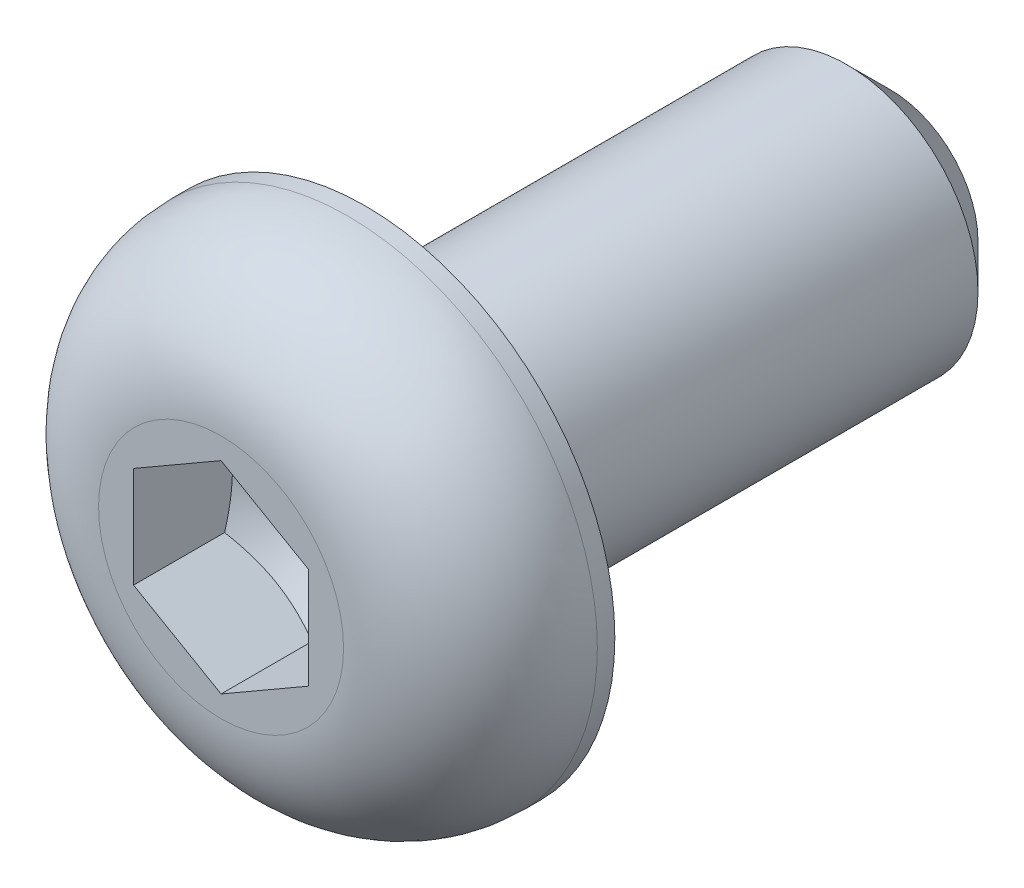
ISO-10303-21;
HEADER;
FILE_DESCRIPTION(('STEP AP214'),'2;1');
FILE_NAME('part.step','',(''),(''),'','','');
FILE_SCHEMA(('AUTOMOTIVE_DESIGN { 1 0 10303 214 1 1 1 1 }'));
ENDSEC;
DATA;
#1=APPLICATION_CONTEXT('core data for automotive mechanical design processes');
#2=APPLICATION_PROTOCOL_DEFINITION('international standard','automotive_design',2000,#1);
#3=PRODUCT_CONTEXT('',#1,'mechanical');
#4=PRODUCT('Part','Part','',(#3));
#5=PRODUCT_RELATED_PRODUCT_CATEGORY('part','',(#4));
#6=PRODUCT_DEFINITION_FORMATION('','',#4);
#7=PRODUCT_DEFINITION_CONTEXT('part definition',#1,'design');
#8=PRODUCT_DEFINITION('design','',#6,#7);
#9=PRODUCT_DEFINITION_SHAPE('','',#8);
#10=(LENGTH_UNIT() NAMED_UNIT(*) SI_UNIT(.MILLI.,.METRE.));
#11=(NAMED_UNIT(*) PLANE_ANGLE_UNIT() SI_UNIT($,.RADIAN.));
#12=(NAMED_UNIT(*) SI_UNIT($,.STERADIAN.) SOLID_ANGLE_UNIT());
#13=UNCERTAINTY_MEASURE_WITH_UNIT(LENGTH_MEASURE(1.E-05),#10,'distance_accuracy_value','');
#14=(GEOMETRIC_REPRESENTATION_CONTEXT(3) GLOBAL_UNCERTAINTY_ASSIGNED_CONTEXT((#13)) GLOBAL_UNIT_ASSIGNED_CONTEXT((#10,
#11,#12)) REPRESENTATION_CONTEXT('',''));
#15=CARTESIAN_POINT('',(0.,0.,0.));
#16=DIRECTION('',(0.,0.,1.));
#17=DIRECTION('',(1.,0.,0.));
#18=AXIS2_PLACEMENT_3D('',#15,#16,#17);
#19=CARTESIAN_POINT('',(0.999999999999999,0.577350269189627,-1.04));
#20=DIRECTION('',(0.5,0.866025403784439,0.));
#21=DIRECTION('',(-0.866025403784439,0.5,0.));
#22=AXIS2_PLACEMENT_3D('',#19,#20,#21);
#23=PLANE('',#22);
#24=CARTESIAN_POINT('',(1.0002,0.577234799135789,-1.04051036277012));
#25=CARTESIAN_POINT('',(0.956252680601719,0.602607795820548,-1.05516806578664));
#26=CARTESIAN_POINT('',(0.911926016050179,0.628199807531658,-1.06849931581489));
#27=CARTESIAN_POINT('',(0.822504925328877,0.679827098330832,-1.09177053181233));
#28=CARTESIAN_POINT('',(0.777408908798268,0.705863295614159,-1.101702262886));
#29=CARTESIAN_POINT('',(0.687775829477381,0.757612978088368,-1.1171643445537));
#30=CARTESIAN_POINT('',(0.64325256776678,0.783318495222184,-1.12279757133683));
#31=CARTESIAN_POINT('',(0.553996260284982,0.834850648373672,-1.12952575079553));
#32=CARTESIAN_POINT('',(0.509263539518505,0.860677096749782,-1.13062627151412));
#33=CARTESIAN_POINT('',(0.425658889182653,0.90894626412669,-1.12835198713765));
#34=CARTESIAN_POINT('',(0.386774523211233,0.931396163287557,-1.12553560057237));
#35=CARTESIAN_POINT('',(0.309259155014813,0.976149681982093,-1.11660458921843));
#36=CARTESIAN_POINT('',(0.270628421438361,0.998453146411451,-1.11048690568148));
#37=CARTESIAN_POINT('',(0.192952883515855,1.04329913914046,-1.09519131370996));
#38=CARTESIAN_POINT('',(0.153917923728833,1.0658359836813,-1.08594848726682));
#39=CARTESIAN_POINT('',(0.0764306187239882,1.11057330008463,-1.06497019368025));
#40=CARTESIAN_POINT('',(0.0379772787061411,1.13277434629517,-1.05323966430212));
#41=CARTESIAN_POINT('',(-0.000199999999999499,1.15481600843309,-1.04051036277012));
#42=B_SPLINE_CURVE_WITH_KNOTS('',3,(#24,#25,#26,#27,#28,#29,#30,#31,#32,#33,#34,#35,#36,#37,#38,
#39,#40,#41),.UNSPECIFIED.,.F.,.F.,(4,2,2,2,2,2,2,2,4),(0.,0.158523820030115,0.317428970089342,
0.472400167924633,0.627180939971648,0.76201658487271,0.896977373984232,1.03493410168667,
1.17261952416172),.UNSPECIFIED.);
#43=CARTESIAN_POINT('',(0.999999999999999,0.577350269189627,-1.04057703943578));
#44=VERTEX_POINT('',#43);
#45=CARTESIAN_POINT('',(0.,1.15470053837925,-1.04057703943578));
#46=VERTEX_POINT('',#45);
#47=EDGE_CURVE('E58',#44,#46,#42,.T.);
#48=ORIENTED_EDGE('',*,*,#47,.F.);
#49=DIRECTION('',(0.,0.,1.));
#50=VECTOR('',#49,1.);
#51=CARTESIAN_POINT('',(0.999999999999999,0.577350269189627,-1.04));
#52=LINE('',#51,#50);
#53=CARTESIAN_POINT('',(0.999999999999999,0.577350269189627,0.));
#54=VERTEX_POINT('',#53);
#55=EDGE_CURVE('E220',#44,#54,#52,.T.);
#56=ORIENTED_EDGE('',*,*,#55,.T.);
#57=DIRECTION('',(-0.866025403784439,0.5,0.));
#58=VECTOR('',#57,1.);
#59=CARTESIAN_POINT('',(0.999999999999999,0.577350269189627,0.));
#60=LINE('',#59,#58);
#61=CARTESIAN_POINT('',(0.,1.15470053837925,0.));
#62=VERTEX_POINT('',#61);
#63=EDGE_CURVE('E108',#54,#62,#60,.T.);
#64=ORIENTED_EDGE('',*,*,#63,.T.);
#65=DIRECTION('',(0.,0.,1.));
#66=VECTOR('',#65,1.);
#67=CARTESIAN_POINT('',(0.,1.15470053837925,-1.04));
#68=LINE('',#67,#66);
#69=EDGE_CURVE('E221',#46,#62,#68,.T.);
#70=ORIENTED_EDGE('',*,*,#69,.F.);
#71=EDGE_LOOP('',(#48,#56,#64,#70));
#72=FACE_BOUND('',#71,.T.);
#73=ADVANCED_FACE('F43',(#72),#23,.F.);
#74=CARTESIAN_POINT('',(0.999999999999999,-0.577350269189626,-1.04));
#75=DIRECTION('',(1.,0.,0.));
#76=DIRECTION('',(0.,0.,-1.));
#77=AXIS2_PLACEMENT_3D('',#74,#75,#76);
#78=PLANE('',#77);
#79=CARTESIAN_POINT('',(0.999999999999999,-1.49540004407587,-0.668619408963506));
#80=CARTESIAN_POINT('',(0.999999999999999,-1.45221011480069,-0.689343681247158));
#81=CARTESIAN_POINT('',(0.999999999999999,-1.40891561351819,-0.709849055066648));
#82=CARTESIAN_POINT('',(0.999999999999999,-1.3220601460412,-0.750307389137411));
#83=CARTESIAN_POINT('',(0.999999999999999,-1.2784991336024,-0.770260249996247));
#84=CARTESIAN_POINT('',(0.999999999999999,-1.14682976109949,-0.829342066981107));
#85=CARTESIAN_POINT('',(0.999999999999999,-1.05825141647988,-0.867443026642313));
#86=CARTESIAN_POINT('',(0.999999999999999,-0.877000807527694,-0.940267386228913));
#87=CARTESIAN_POINT('',(0.999999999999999,-0.784282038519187,-0.974876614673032));
#88=CARTESIAN_POINT('',(0.999999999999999,-0.59645637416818,-1.03646689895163));
#89=CARTESIAN_POINT('',(0.999999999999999,-0.501356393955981,-1.06346775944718));
#90=CARTESIAN_POINT('',(0.999999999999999,-0.356793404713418,-1.09478311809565));
#91=CARTESIAN_POINT('',(0.999999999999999,-0.308336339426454,-1.10368625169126));
#92=CARTESIAN_POINT('',(0.999999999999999,-0.210878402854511,-1.11782393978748));
#93=CARTESIAN_POINT('',(0.999999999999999,-0.161877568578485,-1.12305874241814));
#94=CARTESIAN_POINT('',(0.999999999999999,-0.0641913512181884,-1.12937492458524));
#95=CARTESIAN_POINT('',(0.999999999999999,-0.0155092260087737,-1.13050533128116));
#96=CARTESIAN_POINT('',(0.999999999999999,0.0817745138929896,-1.12864791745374));
#97=CARTESIAN_POINT('',(0.999999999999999,0.130376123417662,-1.12565984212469));
#98=CARTESIAN_POINT('',(0.999999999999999,0.250286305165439,-1.11347023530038));
#99=CARTESIAN_POINT('',(0.999999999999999,0.321363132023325,-1.10198409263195));
#100=CARTESIAN_POINT('',(0.999999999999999,0.462129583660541,-1.07236075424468));
#101=CARTESIAN_POINT('',(0.999999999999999,0.531817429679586,-1.05421554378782));
#102=CARTESIAN_POINT('',(0.999999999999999,0.671301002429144,-1.01274424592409));
#103=CARTESIAN_POINT('',(0.999999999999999,0.741064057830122,-0.989311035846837));
#104=CARTESIAN_POINT('',(0.999999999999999,0.879308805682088,-0.939061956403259));
#105=CARTESIAN_POINT('',(0.999999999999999,0.947790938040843,-0.912247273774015));
#106=CARTESIAN_POINT('',(0.999999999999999,1.12202285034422,-0.840576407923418));
#107=CARTESIAN_POINT('',(0.999999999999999,1.22707987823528,-0.79405244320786));
#108=CARTESIAN_POINT('',(0.999999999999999,1.43568609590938,-0.69773524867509));
#109=CARTESIAN_POINT('',(0.999999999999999,1.53923489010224,-0.64794117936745));
#110=CARTESIAN_POINT('',(0.999999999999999,1.7454488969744,-0.546249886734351));
#111=CARTESIAN_POINT('',(0.999999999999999,1.84811286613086,-0.494350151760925));
#112=CARTESIAN_POINT('',(0.999999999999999,2.05273697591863,-0.389219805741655));
#113=CARTESIAN_POINT('',(0.999999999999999,2.15469720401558,-0.335989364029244));
#114=CARTESIAN_POINT('',(0.999999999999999,2.34852729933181,-0.233677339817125));
#115=CARTESIAN_POINT('',(0.999999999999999,2.44044096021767,-0.184678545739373));
#116=CARTESIAN_POINT('',(0.999999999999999,2.62397259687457,-0.0861228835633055));
#117=CARTESIAN_POINT('',(0.999999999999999,2.71559056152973,-0.0365659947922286));
#118=CARTESIAN_POINT('',(0.999999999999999,2.89836583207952,0.062839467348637));
#119=CARTESIAN_POINT('',(0.999999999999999,2.98952371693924,0.11268697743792));
#120=CARTESIAN_POINT('',(0.999999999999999,3.17165518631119,0.212706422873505));
#121=CARTESIAN_POINT('',(0.999999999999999,3.26262878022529,0.262878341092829));
#122=CARTESIAN_POINT('',(0.999999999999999,3.35353616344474,0.313169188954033));
#123=B_SPLINE_CURVE_WITH_KNOTS('',3,(#79,#80,#81,#82,#83,#84,#85,#86,#87,#88,#89,#90,#91,#92,
#93,#94,#95,#96,#97,#98,#99,#100,#101,#102,#103,#104,#105,#106,#107,#108,#109,#110,#111,#112,
#113,#114,#115,#116,#117,#118,#119,#120,#121,#122),.UNSPECIFIED.,.F.,.F.,(4,2,2,2,2,2,2,2,2,2,2,
2,2,2,2,2,2,2,2,2,2,4),(0.,0.143711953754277,0.287449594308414,0.576647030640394,
0.87339588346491,1.16936500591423,1.31705433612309,1.46473367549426,1.61064306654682,
1.75656148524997,1.97211190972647,2.18792262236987,2.40857617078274,2.6291524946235,
2.97373435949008,3.31840503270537,3.66349966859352,4.00855061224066,4.32102377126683,
4.6335085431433,4.94519806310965,5.25687125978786),.UNSPECIFIED.);
#124=CARTESIAN_POINT('',(0.999999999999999,-0.577350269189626,-1.04057703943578));
#125=VERTEX_POINT('',#124);
#126=EDGE_CURVE('E65',#125,#44,#123,.T.);
#127=ORIENTED_EDGE('',*,*,#126,.F.);
#128=DIRECTION('',(0.,0.,1.));
#129=VECTOR('',#128,1.);
#130=CARTESIAN_POINT('',(0.999999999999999,-0.577350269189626,-1.04));
#131=LINE('',#130,#129);
#132=CARTESIAN_POINT('',(0.999999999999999,-0.577350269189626,0.));
#133=VERTEX_POINT('',#132);
#134=EDGE_CURVE('E230',#125,#133,#131,.T.);
#135=ORIENTED_EDGE('',*,*,#134,.T.);
#136=DIRECTION('',(0.,1.,0.));
#137=VECTOR('',#136,1.);
#138=CARTESIAN_POINT('',(0.999999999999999,-0.577350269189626,0.));
#139=LINE('',#138,#137);
#140=EDGE_CURVE('E224',#133,#54,#139,.T.);
#141=ORIENTED_EDGE('',*,*,#140,.T.);
#142=ORIENTED_EDGE('',*,*,#55,.F.);
#143=EDGE_LOOP('',(#127,#135,#141,#142));
#144=FACE_BOUND('',#143,.T.);
#145=ADVANCED_FACE('F129',(#144),#78,.F.);
#146=CARTESIAN_POINT('',(0.,-1.15470053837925,-1.04));
#147=DIRECTION('',(0.5,-0.866025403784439,0.));
#148=DIRECTION('',(0.866025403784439,0.5,0.));
#149=AXIS2_PLACEMENT_3D('',#146,#147,#148);
#150=PLANE('',#149);
#151=CARTESIAN_POINT('',(-0.00020000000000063,-1.15481600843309,-1.04051036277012));
#152=CARTESIAN_POINT('',(0.0437473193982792,-1.12944301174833,-1.05516806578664));
#153=CARTESIAN_POINT('',(0.0880739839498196,-1.10385100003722,-1.06849931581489));
#154=CARTESIAN_POINT('',(0.177495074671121,-1.05222370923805,-1.09177053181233));
#155=CARTESIAN_POINT('',(0.222591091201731,-1.02618751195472,-1.101702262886));
#156=CARTESIAN_POINT('',(0.312224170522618,-0.97443782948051,-1.1171643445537));
#157=CARTESIAN_POINT('',(0.356747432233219,-0.948732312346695,-1.12279757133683));
#158=CARTESIAN_POINT('',(0.446003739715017,-0.897200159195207,-1.12952575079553));
#159=CARTESIAN_POINT('',(0.490736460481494,-0.871373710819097,-1.13062627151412));
#160=CARTESIAN_POINT('',(0.574341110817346,-0.823104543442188,-1.12835198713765));
#161=CARTESIAN_POINT('',(0.613225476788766,-0.800654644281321,-1.12553560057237));
#162=CARTESIAN_POINT('',(0.690740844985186,-0.755901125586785,-1.11660458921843));
#163=CARTESIAN_POINT('',(0.729371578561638,-0.733597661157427,-1.11048690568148));
#164=CARTESIAN_POINT('',(0.807047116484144,-0.688751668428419,-1.09519131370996));
#165=CARTESIAN_POINT('',(0.846082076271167,-0.666214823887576,-1.08594848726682));
#166=CARTESIAN_POINT('',(0.923569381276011,-0.62147750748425,-1.06497019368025));
#167=CARTESIAN_POINT('',(0.962022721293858,-0.599276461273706,-1.05323966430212));
#168=CARTESIAN_POINT('',(1.0002,-0.577234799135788,-1.04051036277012));
#169=B_SPLINE_CURVE_WITH_KNOTS('',3,(#151,#152,#153,#154,#155,#156,#157,#158,#159,#160,#161,
#162,#163,#164,#165,#166,#167,#168),.UNSPECIFIED.,.F.,.F.,(4,2,2,2,2,2,2,2,4),(0.,
0.158523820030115,0.317428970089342,0.472400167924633,0.627180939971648,0.762016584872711,
0.896977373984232,1.03493410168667,1.17261952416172),.UNSPECIFIED.);
#170=CARTESIAN_POINT('',(0.,-1.15470053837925,-1.04057703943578));
#171=VERTEX_POINT('',#170);
#172=EDGE_CURVE('E106',#171,#125,#169,.T.);
#173=ORIENTED_EDGE('',*,*,#172,.F.);
#174=DIRECTION('',(0.,0.,1.));
#175=VECTOR('',#174,1.);
#176=CARTESIAN_POINT('',(0.,-1.15470053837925,-1.04));
#177=LINE('',#176,#175);
#178=CARTESIAN_POINT('',(0.,-1.15470053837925,0.));
#179=VERTEX_POINT('',#178);
#180=EDGE_CURVE('E228',#171,#179,#177,.T.);
#181=ORIENTED_EDGE('',*,*,#180,.T.);
#182=DIRECTION('',(0.866025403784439,0.5,0.));
#183=VECTOR('',#182,1.);
#184=CARTESIAN_POINT('',(0.,-1.15470053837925,0.));
#185=LINE('',#184,#183);
#186=EDGE_CURVE('E235',#179,#133,#185,.T.);
#187=ORIENTED_EDGE('',*,*,#186,.T.);
#188=ORIENTED_EDGE('',*,*,#134,.F.);
#189=EDGE_LOOP('',(#173,#181,#187,#188));
#190=FACE_BOUND('',#189,.T.);
#191=ADVANCED_FACE('F161',(#190),#150,.F.);
#192=CARTESIAN_POINT('',(-1.,-0.577350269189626,-1.04));
#193=DIRECTION('',(-0.5,-0.866025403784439,0.));
#194=DIRECTION('',(0.866025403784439,-0.5,0.));
#195=AXIS2_PLACEMENT_3D('',#192,#193,#194);
#196=PLANE('',#195);
#197=CARTESIAN_POINT('',(-1.0002,-0.577234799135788,-1.04051036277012));
#198=CARTESIAN_POINT('',(-0.95625268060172,-0.602607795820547,-1.05516806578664));
#199=CARTESIAN_POINT('',(-0.91192601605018,-0.628199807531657,-1.06849931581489));
#200=CARTESIAN_POINT('',(-0.822504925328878,-0.679827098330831,-1.09177053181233));
#201=CARTESIAN_POINT('',(-0.777408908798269,-0.705863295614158,-1.101702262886));
#202=CARTESIAN_POINT('',(-0.687775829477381,-0.757612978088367,-1.1171643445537));
#203=CARTESIAN_POINT('',(-0.643252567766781,-0.783318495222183,-1.12279757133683));
#204=CARTESIAN_POINT('',(-0.553996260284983,-0.834850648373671,-1.12952575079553));
#205=CARTESIAN_POINT('',(-0.509263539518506,-0.860677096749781,-1.13062627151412));
#206=CARTESIAN_POINT('',(-0.425658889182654,-0.90894626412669,-1.12835198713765));
#207=CARTESIAN_POINT('',(-0.386774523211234,-0.931396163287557,-1.12553560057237));
#208=CARTESIAN_POINT('',(-0.309259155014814,-0.976149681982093,-1.11660458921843));
#209=CARTESIAN_POINT('',(-0.270628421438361,-0.998453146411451,-1.11048690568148));
#210=CARTESIAN_POINT('',(-0.192952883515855,-1.04329913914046,-1.09519131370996));
#211=CARTESIAN_POINT('',(-0.153917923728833,-1.0658359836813,-1.08594848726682));
#212=CARTESIAN_POINT('',(-0.0764306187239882,-1.11057330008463,-1.06497019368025));
#213=CARTESIAN_POINT('',(-0.037977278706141,-1.13277434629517,-1.05323966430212));
#214=CARTESIAN_POINT('',(0.000199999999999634,-1.15481600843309,-1.04051036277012));
#215=B_SPLINE_CURVE_WITH_KNOTS('',3,(#197,#198,#199,#200,#201,#202,#203,#204,#205,#206,#207,
#208,#209,#210,#211,#212,#213,#214),.UNSPECIFIED.,.F.,.F.,(4,2,2,2,2,2,2,2,4),(0.,
0.158523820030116,0.317428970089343,0.472400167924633,0.627180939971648,0.762016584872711,
0.896977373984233,1.03493410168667,1.17261952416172),.UNSPECIFIED.);
#216=CARTESIAN_POINT('',(-1.,-0.577350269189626,-1.04057703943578));
#217=VERTEX_POINT('',#216);
#218=EDGE_CURVE('E110',#217,#171,#215,.T.);
#219=ORIENTED_EDGE('',*,*,#218,.F.);
#220=DIRECTION('',(0.,0.,1.));
#221=VECTOR('',#220,1.);
#222=CARTESIAN_POINT('',(-1.,-0.577350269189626,-1.04));
#223=LINE('',#222,#221);
#224=CARTESIAN_POINT('',(-1.,-0.577350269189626,0.));
#225=VERTEX_POINT('',#224);
#226=EDGE_CURVE('E226',#217,#225,#223,.T.);
#227=ORIENTED_EDGE('',*,*,#226,.T.);
#228=DIRECTION('',(0.866025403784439,-0.5,0.));
#229=VECTOR('',#228,1.);
#230=CARTESIAN_POINT('',(-1.,-0.577350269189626,0.));
#231=LINE('',#230,#229);
#232=EDGE_CURVE('E238',#225,#179,#231,.T.);
#233=ORIENTED_EDGE('',*,*,#232,.T.);
#234=ORIENTED_EDGE('',*,*,#180,.F.);
#235=EDGE_LOOP('',(#219,#227,#233,#234));
#236=FACE_BOUND('',#235,.T.);
#237=ADVANCED_FACE('F157',(#236),#196,.F.);
#238=CARTESIAN_POINT('',(-1.,0.577350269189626,-1.04));
#239=DIRECTION('',(-1.,0.,0.));
#240=DIRECTION('',(0.,-1.,0.));
#241=AXIS2_PLACEMENT_3D('',#238,#239,#240);
#242=PLANE('',#241);
#243=CARTESIAN_POINT('',(-1.,-1.49540004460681,-0.668619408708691));
#244=CARTESIAN_POINT('',(-1.,-1.45221011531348,-0.689343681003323));
#245=CARTESIAN_POINT('',(-1.,-1.40891561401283,-0.709849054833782));
#246=CARTESIAN_POINT('',(-1.,-1.32206014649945,-0.750307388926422));
#247=CARTESIAN_POINT('',(-1.,-1.27849913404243,-0.770260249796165));
#248=CARTESIAN_POINT('',(-1.,-1.1468297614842,-0.829342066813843));
#249=CARTESIAN_POINT('',(-1.,-1.05825141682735,-0.867443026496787));
#250=CARTESIAN_POINT('',(-1.,-0.87700080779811,-0.940267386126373));
#251=CARTESIAN_POINT('',(-1.,-0.784282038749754,-0.974876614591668));
#252=CARTESIAN_POINT('',(-1.,-0.596456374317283,-1.03646689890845));
#253=CARTESIAN_POINT('',(-1.,-0.501356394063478,-1.06346775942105));
#254=CARTESIAN_POINT('',(-1.,-0.35679340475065,-1.094783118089));
#255=CARTESIAN_POINT('',(-1.,-0.308336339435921,-1.10368625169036));
#256=CARTESIAN_POINT('',(-1.,-0.210878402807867,-1.11782393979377));
#257=CARTESIAN_POINT('',(-1.,-0.161877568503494,-1.12305874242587));
#258=CARTESIAN_POINT('',(-1.,-0.0641913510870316,-1.12937492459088));
#259=CARTESIAN_POINT('',(-1.,-0.0155092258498,-1.13050533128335));
#260=CARTESIAN_POINT('',(-1.,0.0817745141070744,-1.12864791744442));
#261=CARTESIAN_POINT('',(-1.,0.130376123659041,-1.12565984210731));
#262=CARTESIAN_POINT('',(-1.,0.250286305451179,-1.1134702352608));
#263=CARTESIAN_POINT('',(-1.,0.321363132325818,-1.1019840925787));
#264=CARTESIAN_POINT('',(-1.,0.462129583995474,-1.0723607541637));
#265=CARTESIAN_POINT('',(-1.,0.531817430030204,-1.05421554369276));
#266=CARTESIAN_POINT('',(-1.,0.671301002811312,-1.01274424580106));
#267=CARTESIAN_POINT('',(-1.,0.741064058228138,-0.989311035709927));
#268=CARTESIAN_POINT('',(-1.,0.879308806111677,-0.939061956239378));
#269=CARTESIAN_POINT('',(-1.,0.947790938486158,-0.912247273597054));
#270=CARTESIAN_POINT('',(-1.,1.12202285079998,-0.84057640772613));
#271=CARTESIAN_POINT('',(-1.,1.22707987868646,-0.794052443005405));
#272=CARTESIAN_POINT('',(-1.,1.43568609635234,-0.697735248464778));
#273=CARTESIAN_POINT('',(-1.,1.53923489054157,-0.647941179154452));
#274=CARTESIAN_POINT('',(-1.,1.74544889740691,-0.546249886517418));
#275=CARTESIAN_POINT('',(-1.,1.84811286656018,-0.494350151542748));
#276=CARTESIAN_POINT('',(-1.,2.05273697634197,-0.389219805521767));
#277=CARTESIAN_POINT('',(-1.,2.15469720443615,-0.335989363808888));
#278=CARTESIAN_POINT('',(-1.,2.34852729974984,-0.233677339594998));
#279=CARTESIAN_POINT('',(-1.,2.44044096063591,-0.184678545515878));
#280=CARTESIAN_POINT('',(-1.,2.62397259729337,-0.0861228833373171));
#281=CARTESIAN_POINT('',(-1.,2.71559056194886,-0.0365659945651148));
#282=CARTESIAN_POINT('',(-1.,2.89836583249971,0.0628394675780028));
#283=CARTESIAN_POINT('',(-1.,2.98952371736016,0.112686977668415));
#284=CARTESIAN_POINT('',(-1.,3.17165518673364,0.212706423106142));
#285=CARTESIAN_POINT('',(-1.,3.26262878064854,0.26287834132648));
#286=CARTESIAN_POINT('',(-1.,3.35353616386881,0.313169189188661));
#287=B_SPLINE_CURVE_WITH_KNOTS('',3,(#243,#244,#245,#246,#247,#248,#249,#250,#251,#252,#253,
#254,#255,#256,#257,#258,#259,#260,#261,#262,#263,#264,#265,#266,#267,#268,#269,#270,#271,#272,
#273,#274,#275,#276,#277,#278,#279,#280,#281,#282,#283,#284,#285,#286),.UNSPECIFIED.,.F.,.F.,(4,
2,2,2,2,2,2,2,2,2,2,2,2,2,2,2,2,2,2,2,2,4),(0.,0.143711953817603,0.287449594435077,
0.576647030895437,0.873395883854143,1.16936500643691,1.31705433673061,1.46473367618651,
1.61064306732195,1.75656148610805,1.97211191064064,2.18792262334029,2.40857617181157,
2.62915249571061,2.97373436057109,3.31840503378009,3.66349966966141,4.00855061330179,
4.32102377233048,4.63350854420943,4.94519806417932,5.25687126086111),.UNSPECIFIED.);
#288=CARTESIAN_POINT('',(-1.,0.577350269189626,-1.04057703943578));
#289=VERTEX_POINT('',#288);
#290=EDGE_CURVE('E145',#289,#217,#287,.F.);
#291=ORIENTED_EDGE('',*,*,#290,.F.);
#292=DIRECTION('',(0.,0.,1.));
#293=VECTOR('',#292,1.);
#294=CARTESIAN_POINT('',(-1.,0.577350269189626,-1.04));
#295=LINE('',#294,#293);
#296=CARTESIAN_POINT('',(-1.,0.577350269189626,0.));
#297=VERTEX_POINT('',#296);
#298=EDGE_CURVE('E223',#289,#297,#295,.T.);
#299=ORIENTED_EDGE('',*,*,#298,.T.);
#300=DIRECTION('',(0.,-1.,0.));
#301=VECTOR('',#300,1.);
#302=CARTESIAN_POINT('',(-1.,0.577350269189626,0.));
#303=LINE('',#302,#301);
#304=EDGE_CURVE('E241',#297,#225,#303,.T.);
#305=ORIENTED_EDGE('',*,*,#304,.T.);
#306=ORIENTED_EDGE('',*,*,#226,.F.);
#307=EDGE_LOOP('',(#291,#299,#305,#306));
#308=FACE_BOUND('',#307,.T.);
#309=ADVANCED_FACE('F160',(#308),#242,.F.);
#310=CARTESIAN_POINT('',(0.,1.15470053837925,-1.04));
#311=DIRECTION('',(-0.5,0.866025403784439,0.));
#312=DIRECTION('',(-0.866025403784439,-0.5,0.));
#313=AXIS2_PLACEMENT_3D('',#310,#311,#312);
#314=PLANE('',#313);
#315=CARTESIAN_POINT('',(0.000200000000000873,1.15481600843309,-1.04051036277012));
#316=CARTESIAN_POINT('',(-0.0437473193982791,1.12944301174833,-1.05516806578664));
#317=CARTESIAN_POINT('',(-0.0880739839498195,1.10385100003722,-1.06849931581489));
#318=CARTESIAN_POINT('',(-0.177495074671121,1.05222370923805,-1.09177053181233));
#319=CARTESIAN_POINT('',(-0.222591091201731,1.02618751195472,-1.101702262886));
#320=CARTESIAN_POINT('',(-0.312224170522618,0.97443782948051,-1.1171643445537));
#321=CARTESIAN_POINT('',(-0.356747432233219,0.948732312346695,-1.12279757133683));
#322=CARTESIAN_POINT('',(-0.446003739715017,0.897200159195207,-1.12952575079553));
#323=CARTESIAN_POINT('',(-0.490736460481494,0.871373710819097,-1.13062627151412));
#324=CARTESIAN_POINT('',(-0.574341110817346,0.823104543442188,-1.12835198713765));
#325=CARTESIAN_POINT('',(-0.613225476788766,0.800654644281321,-1.12553560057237));
#326=CARTESIAN_POINT('',(-0.690740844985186,0.755901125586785,-1.11660458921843));
#327=CARTESIAN_POINT('',(-0.729371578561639,0.733597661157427,-1.11048690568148));
#328=CARTESIAN_POINT('',(-0.807047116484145,0.688751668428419,-1.09519131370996));
#329=CARTESIAN_POINT('',(-0.846082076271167,0.666214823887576,-1.08594848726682));
#330=CARTESIAN_POINT('',(-0.923569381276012,0.62147750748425,-1.06497019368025));
#331=CARTESIAN_POINT('',(-0.962022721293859,0.599276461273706,-1.05323966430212));
#332=CARTESIAN_POINT('',(-1.0002,0.577234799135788,-1.04051036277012));
#333=B_SPLINE_CURVE_WITH_KNOTS('',3,(#315,#316,#317,#318,#319,#320,#321,#322,#323,#324,#325,
#326,#327,#328,#329,#330,#331,#332),.UNSPECIFIED.,.F.,.F.,(4,2,2,2,2,2,2,2,4),(0.,
0.158523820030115,0.317428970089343,0.472400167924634,0.627180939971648,0.762016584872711,
0.896977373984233,1.03493410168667,1.17261952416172),.UNSPECIFIED.);
#334=EDGE_CURVE('E135',#46,#289,#333,.T.);
#335=ORIENTED_EDGE('',*,*,#334,.F.);
#336=ORIENTED_EDGE('',*,*,#69,.T.);
#337=DIRECTION('',(-0.866025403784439,-0.5,0.));
#338=VECTOR('',#337,1.);
#339=CARTESIAN_POINT('',(0.,1.15470053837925,0.));
#340=LINE('',#339,#338);
#341=EDGE_CURVE('E244',#62,#297,#340,.T.);
#342=ORIENTED_EDGE('',*,*,#341,.T.);
#343=ORIENTED_EDGE('',*,*,#298,.F.);
#344=EDGE_LOOP('',(#335,#336,#342,#343));
#345=FACE_BOUND('',#344,.T.);
#346=ADVANCED_FACE('F166',(#345),#314,.F.);
#347=CARTESIAN_POINT('',(0.,0.,0.));
#348=DIRECTION('',(0.,0.,-1.));
#349=DIRECTION('',(-1.,0.,0.));
#350=AXIS2_PLACEMENT_3D('',#347,#348,#349);
#351=PLANE('',#350);
#352=ORIENTED_EDGE('',*,*,#341,.F.);
#353=ORIENTED_EDGE('',*,*,#63,.F.);
#354=ORIENTED_EDGE('',*,*,#140,.F.);
#355=ORIENTED_EDGE('',*,*,#186,.F.);
#356=ORIENTED_EDGE('',*,*,#232,.F.);
#357=ORIENTED_EDGE('',*,*,#304,.F.);
#358=EDGE_LOOP('',(#352,#353,#354,#355,#356,#357));
#359=FACE_BOUND('',#358,.T.);
#360=CARTESIAN_POINT('',(0.,0.,0.));
#361=DIRECTION('',(0.,0.,-1.));
#362=DIRECTION('',(-1.,0.,0.));
#363=AXIS2_PLACEMENT_3D('',#360,#361,#362);
#364=CIRCLE('',#363,1.4);
#365=CARTESIAN_POINT('',(-1.4,0.,0.));
#366=VERTEX_POINT('',#365);
#367=EDGE_CURVE('E212',#366,#366,#364,.F.);
#368=ORIENTED_EDGE('',*,*,#367,.T.);
#369=EDGE_LOOP('',(#368));
#370=FACE_BOUND('',#369,.T.);
#371=ADVANCED_FACE('F170',(#359,#370),#351,.F.);
#372=CARTESIAN_POINT('',(0.,0.,0.));
#373=DIRECTION('',(0.,0.,1.));
#374=DIRECTION('',(1.,0.,0.));
#375=AXIS2_PLACEMENT_3D('',#372,#373,#374);
#376=CYLINDRICAL_SURFACE('',#375,2.85);
#377=CARTESIAN_POINT('',(0.,0.,-1.45));
#378=DIRECTION('',(0.,0.,-1.));
#379=DIRECTION('',(-1.,0.,0.));
#380=AXIS2_PLACEMENT_3D('',#377,#378,#379);
#381=CIRCLE('',#380,2.85);
#382=CARTESIAN_POINT('',(-2.85,0.,-1.45));
#383=VERTEX_POINT('',#382);
#384=EDGE_CURVE('E209',#383,#383,#381,.T.);
#385=ORIENTED_EDGE('',*,*,#384,.T.);
#386=EDGE_LOOP('',(#385));
#387=FACE_BOUND('',#386,.T.);
#388=CARTESIAN_POINT('',(0.,0.,-1.65));
#389=DIRECTION('',(0.,0.,1.));
#390=DIRECTION('',(1.,0.,0.));
#391=AXIS2_PLACEMENT_3D('',#388,#389,#390);
#392=CIRCLE('',#391,2.85);
#393=CARTESIAN_POINT('',(2.85,0.,-1.65));
#394=VERTEX_POINT('',#393);
#395=EDGE_CURVE('E217',#394,#394,#392,.T.);
#396=ORIENTED_EDGE('',*,*,#395,.T.);
#397=EDGE_LOOP('',(#396));
#398=FACE_BOUND('',#397,.T.);
#399=ADVANCED_FACE('F187',(#387,#398),#376,.T.);
#400=CARTESIAN_POINT('',(0.,2.85,-1.65));
#401=DIRECTION('',(0.,0.,1.));
#402=DIRECTION('',(1.,0.,0.));
#403=AXIS2_PLACEMENT_3D('',#400,#401,#402);
#404=PLANE('',#403);
#405=CARTESIAN_POINT('',(0.,0.,-1.65));
#406=DIRECTION('',(0.,0.,1.));
#407=DIRECTION('',(1.,0.,0.));
#408=AXIS2_PLACEMENT_3D('',#405,#406,#407);
#409=CIRCLE('',#408,1.6);
#410=CARTESIAN_POINT('',(1.6,0.,-1.65));
#411=VERTEX_POINT('',#410);
#412=EDGE_CURVE('E51',#411,#411,#409,.T.);
#413=ORIENTED_EDGE('',*,*,#412,.T.);
#414=EDGE_LOOP('',(#413));
#415=FACE_BOUND('',#414,.T.);
#416=ORIENTED_EDGE('',*,*,#395,.F.);
#417=EDGE_LOOP('',(#416));
#418=FACE_BOUND('',#417,.T.);
#419=ADVANCED_FACE('F183',(#415,#418),#404,.F.);
#420=CARTESIAN_POINT('',(0.,0.,0.));
#421=DIRECTION('',(0.,0.,1.));
#422=DIRECTION('',(1.,0.,0.));
#423=AXIS2_PLACEMENT_3D('',#420,#421,#422);
#424=CYLINDRICAL_SURFACE('',#423,1.5);
#425=CARTESIAN_POINT('',(0.,0.,-1.75));
#426=DIRECTION('',(0.,0.,1.));
#427=DIRECTION('',(1.,0.,0.));
#428=AXIS2_PLACEMENT_3D('',#425,#426,#427);
#429=CIRCLE('',#428,1.5);
#430=CARTESIAN_POINT('',(1.5,0.,-1.75));
#431=VERTEX_POINT('',#430);
#432=EDGE_CURVE('E11',#431,#431,#429,.F.);
#433=ORIENTED_EDGE('',*,*,#432,.T.);
#434=EDGE_LOOP('',(#433));
#435=FACE_BOUND('',#434,.T.);
#436=CARTESIAN_POINT('',(0.,0.,-7.15));
#437=DIRECTION('',(0.,0.,1.));
#438=DIRECTION('',(1.,0.,0.));
#439=AXIS2_PLACEMENT_3D('',#436,#437,#438);
#440=CIRCLE('',#439,1.5);
#441=CARTESIAN_POINT('',(1.5,0.,-7.15));
#442=VERTEX_POINT('',#441);
#443=EDGE_CURVE('E207',#442,#442,#440,.T.);
#444=ORIENTED_EDGE('',*,*,#443,.T.);
#445=EDGE_LOOP('',(#444));
#446=FACE_BOUND('',#445,.T.);
#447=ADVANCED_FACE('F179',(#435,#446),#424,.T.);
#448=CARTESIAN_POINT('',(0.,1.5,-7.65));
#449=DIRECTION('',(0.,0.,1.));
#450=DIRECTION('',(1.,0.,0.));
#451=AXIS2_PLACEMENT_3D('',#448,#449,#450);
#452=PLANE('',#451);
#453=CARTESIAN_POINT('',(0.,0.,-7.65));
#454=DIRECTION('',(0.,0.,1.));
#455=DIRECTION('',(1.,0.,0.));
#456=AXIS2_PLACEMENT_3D('',#453,#454,#455);
#457=CIRCLE('',#456,0.999999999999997);
#458=CARTESIAN_POINT('',(0.999999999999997,0.,-7.65));
#459=VERTEX_POINT('',#458);
#460=EDGE_CURVE('E204',#459,#459,#457,.F.);
#461=ORIENTED_EDGE('',*,*,#460,.T.);
#462=EDGE_LOOP('',(#461));
#463=FACE_BOUND('',#462,.T.);
#464=ADVANCED_FACE('F175',(#463),#452,.F.);
#465=CARTESIAN_POINT('',(0.,0.,-1.45));
#466=DIRECTION('',(0.,0.,-1.));
#467=DIRECTION('',(-1.,0.,0.));
#468=AXIS2_PLACEMENT_3D('',#465,#466,#467);
#469=DEGENERATE_TOROIDAL_SURFACE('',#468,1.4,1.45,.T.);
#470=ORIENTED_EDGE('',*,*,#384,.F.);
#471=EDGE_LOOP('',(#470));
#472=FACE_BOUND('',#471,.T.);
#473=ORIENTED_EDGE('',*,*,#367,.F.);
#474=EDGE_LOOP('',(#473));
#475=FACE_BOUND('',#474,.T.);
#476=ADVANCED_FACE('F178',(#472,#475),#469,.T.);
#477=CARTESIAN_POINT('',(0.,0.,-7.15));
#478=DIRECTION('',(0.,0.,1.));
#479=DIRECTION('',(1.,0.,0.));
#480=AXIS2_PLACEMENT_3D('',#477,#478,#479);
#481=CONICAL_SURFACE('',#480,1.5,0.78539816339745);
#482=ORIENTED_EDGE('',*,*,#460,.F.);
#483=EDGE_LOOP('',(#482));
#484=FACE_BOUND('',#483,.T.);
#485=ORIENTED_EDGE('',*,*,#443,.F.);
#486=EDGE_LOOP('',(#485));
#487=FACE_BOUND('',#486,.T.);
#488=ADVANCED_FACE('F101',(#484,#487),#481,.T.);
#489=CARTESIAN_POINT('',(0.,0.,-1.04));
#490=DIRECTION('',(0.,0.,1.));
#491=DIRECTION('',(1.,0.,0.));
#492=AXIS2_PLACEMENT_3D('',#489,#490,#491);
#493=CONICAL_SURFACE('',#492,1.1557,1.0471975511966);
#494=CARTESIAN_POINT('',(0.,0.,-1.70724370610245));
#495=VERTEX_POINT('',#494);
#496=VERTEX_LOOP('',#495);
#497=FACE_BOUND('',#496,.T.);
#498=ORIENTED_EDGE('',*,*,#126,.T.);
#499=ORIENTED_EDGE('',*,*,#47,.T.);
#500=ORIENTED_EDGE('',*,*,#334,.T.);
#501=ORIENTED_EDGE('',*,*,#290,.T.);
#502=ORIENTED_EDGE('',*,*,#218,.T.);
#503=ORIENTED_EDGE('',*,*,#172,.T.);
#504=EDGE_LOOP('',(#498,#499,#500,#501,#502,#503));
#505=FACE_BOUND('',#504,.T.);
#506=ADVANCED_FACE('F98',(#497,#505),#493,.F.);
#507=CARTESIAN_POINT('',(0.,0.,-1.75));
#508=DIRECTION('',(0.,0.,1.));
#509=DIRECTION('',(1.,0.,0.));
#510=AXIS2_PLACEMENT_3D('',#507,#508,#509);
#511=TOROIDAL_SURFACE('',#510,1.6,0.1);
#512=ORIENTED_EDGE('',*,*,#432,.F.);
#513=EDGE_LOOP('',(#512));
#514=FACE_BOUND('',#513,.T.);
#515=ORIENTED_EDGE('',*,*,#412,.F.);
#516=EDGE_LOOP('',(#515));
#517=FACE_BOUND('',#516,.T.);
#518=ADVANCED_FACE('F45',(#514,#517),#511,.F.);
#519=CLOSED_SHELL('',(#73,#145,#191,#237,#309,#346,#371,#399,#419,#447,#464,#476,#488,#506,#518));
#520=MANIFOLD_SOLID_BREP('B2',#519);
#521=ADVANCED_BREP_SHAPE_REPRESENTATION('',(#18,#520),#14);
#522=SHAPE_DEFINITION_REPRESENTATION(#9,#521);
ENDSEC;
END-ISO-10303-21;
